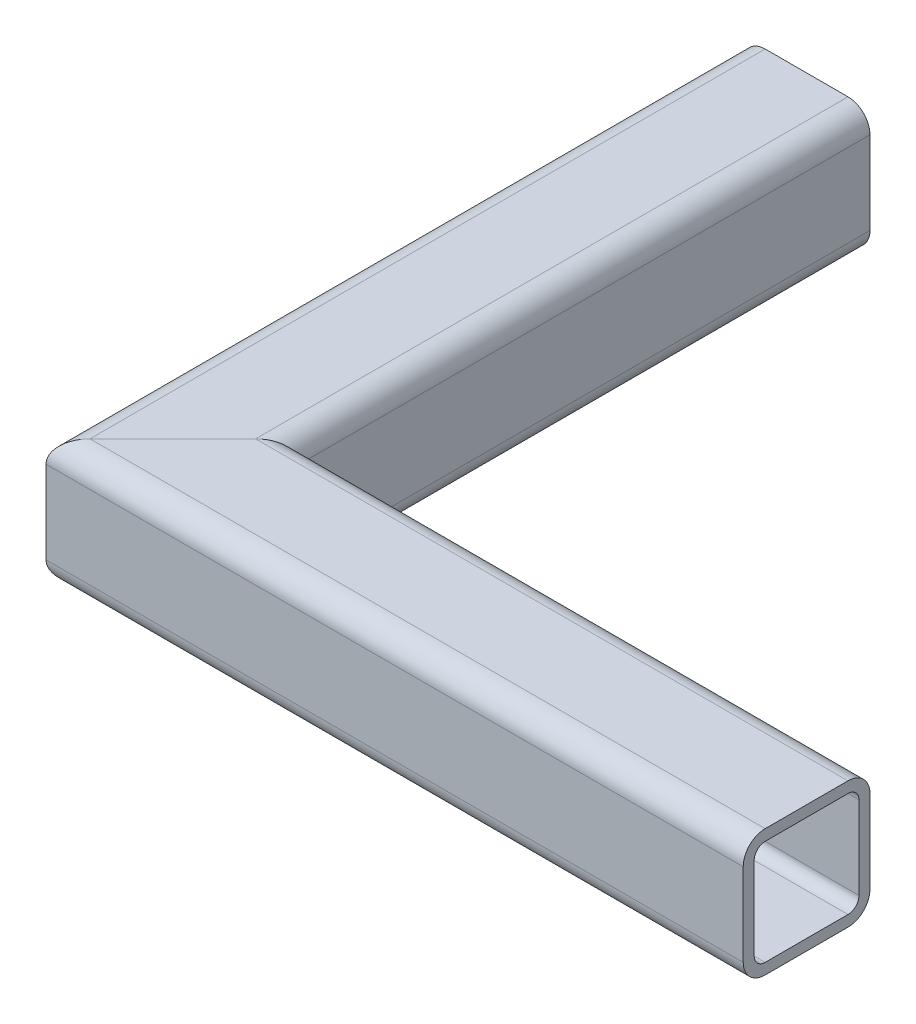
ISO-10303-21;
HEADER;
FILE_DESCRIPTION(('STEP AP214'),'2;1');
FILE_NAME('part.step','',(''),(''),'','','');
FILE_SCHEMA(('AUTOMOTIVE_DESIGN { 1 0 10303 214 1 1 1 1 }'));
ENDSEC;
DATA;
#1=APPLICATION_CONTEXT('core data for automotive mechanical design processes');
#2=APPLICATION_PROTOCOL_DEFINITION('international standard','automotive_design',2000,#1);
#3=PRODUCT_CONTEXT('',#1,'mechanical');
#4=PRODUCT('Part','Part','',(#3));
#5=PRODUCT_RELATED_PRODUCT_CATEGORY('part','',(#4));
#6=PRODUCT_DEFINITION_FORMATION('','',#4);
#7=PRODUCT_DEFINITION_CONTEXT('part definition',#1,'design');
#8=PRODUCT_DEFINITION('design','',#6,#7);
#9=PRODUCT_DEFINITION_SHAPE('','',#8);
#10=(LENGTH_UNIT() NAMED_UNIT(*) SI_UNIT(.MILLI.,.METRE.));
#11=(NAMED_UNIT(*) PLANE_ANGLE_UNIT() SI_UNIT($,.RADIAN.));
#12=(NAMED_UNIT(*) SI_UNIT($,.STERADIAN.) SOLID_ANGLE_UNIT());
#13=UNCERTAINTY_MEASURE_WITH_UNIT(LENGTH_MEASURE(1.E-05),#10,'distance_accuracy_value','');
#14=(GEOMETRIC_REPRESENTATION_CONTEXT(3) GLOBAL_UNCERTAINTY_ASSIGNED_CONTEXT((#13)) GLOBAL_UNIT_ASSIGNED_CONTEXT((#10,
#11,#12)) REPRESENTATION_CONTEXT('',''));
#15=CARTESIAN_POINT('',(0.,0.,0.));
#16=DIRECTION('',(0.,0.,1.));
#17=DIRECTION('',(1.,0.,0.));
#18=AXIS2_PLACEMENT_3D('',#15,#16,#17);
#19=CARTESIAN_POINT('',(-12.4,-9.8,0.));
#20=DIRECTION('',(1.,0.,0.));
#21=DIRECTION('',(0.,0.,-1.));
#22=AXIS2_PLACEMENT_3D('',#19,#20,#21);
#23=PLANE('',#22);
#24=DIRECTION('',(0.,1.,0.));
#25=VECTOR('',#24,1.);
#26=CARTESIAN_POINT('',(-12.4,-9.8,12.4));
#27=LINE('',#26,#25);
#28=CARTESIAN_POINT('',(-12.4,-9.8,12.4));
#29=VERTEX_POINT('',#28);
#30=CARTESIAN_POINT('',(-12.4,9.8,12.4));
#31=VERTEX_POINT('',#30);
#32=EDGE_CURVE('E13',#29,#31,#27,.T.);
#33=ORIENTED_EDGE('',*,*,#32,.F.);
#34=DIRECTION('',(0.,0.,-1.));
#35=VECTOR('',#34,1.);
#36=CARTESIAN_POINT('',(-12.4,-9.8,0.));
#37=LINE('',#36,#35);
#38=CARTESIAN_POINT('',(-12.4,-9.8,-150.));
#39=VERTEX_POINT('',#38);
#40=EDGE_CURVE('E354',#29,#39,#37,.T.);
#41=ORIENTED_EDGE('',*,*,#40,.T.);
#42=DIRECTION('',(0.,-1.,0.));
#43=VECTOR('',#42,1.);
#44=CARTESIAN_POINT('',(-12.4,-9.8,-150.));
#45=LINE('',#44,#43);
#46=CARTESIAN_POINT('',(-12.4,9.80000000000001,-150.));
#47=VERTEX_POINT('',#46);
#48=EDGE_CURVE('E312',#47,#39,#45,.T.);
#49=ORIENTED_EDGE('',*,*,#48,.F.);
#50=DIRECTION('',(0.,0.,-1.));
#51=VECTOR('',#50,1.);
#52=CARTESIAN_POINT('',(-12.4,9.80000000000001,0.));
#53=LINE('',#52,#51);
#54=EDGE_CURVE('E287',#31,#47,#53,.T.);
#55=ORIENTED_EDGE('',*,*,#54,.F.);
#56=EDGE_LOOP('',(#33,#41,#49,#55));
#57=FACE_BOUND('',#56,.T.);
#58=ADVANCED_FACE('F151',(#57),#23,.T.);
#59=CARTESIAN_POINT('',(-9.8,-9.8,0.));
#60=DIRECTION('',(0.,0.,-1.));
#61=DIRECTION('',(-1.,0.,0.));
#62=AXIS2_PLACEMENT_3D('',#59,#60,#61);
#63=CYLINDRICAL_SURFACE('',#62,2.6);
#64=CARTESIAN_POINT('',(-9.8,-9.80000000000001,9.8));
#65=DIRECTION('',(-0.707106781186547,0.,-0.707106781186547));
#66=DIRECTION('',(0.707106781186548,0.,-0.707106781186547));
#67=AXIS2_PLACEMENT_3D('',#64,#65,#66);
#68=ELLIPSE('',#67,3.67695526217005,2.6);
#69=CARTESIAN_POINT('',(-9.8,-12.4,9.79999999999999));
#70=VERTEX_POINT('',#69);
#71=EDGE_CURVE('E395',#70,#29,#68,.T.);
#72=ORIENTED_EDGE('',*,*,#71,.F.);
#73=DIRECTION('',(0.,0.,-1.));
#74=VECTOR('',#73,1.);
#75=CARTESIAN_POINT('',(-9.8,-12.4,0.));
#76=LINE('',#75,#74);
#77=CARTESIAN_POINT('',(-9.8,-12.4,-150.));
#78=VERTEX_POINT('',#77);
#79=EDGE_CURVE('E356',#70,#78,#76,.T.);
#80=ORIENTED_EDGE('',*,*,#79,.T.);
#81=CARTESIAN_POINT('',(-9.8,-9.8,-150.));
#82=DIRECTION('',(0.,0.,1.));
#83=DIRECTION('',(1.,0.,0.));
#84=AXIS2_PLACEMENT_3D('',#81,#82,#83);
#85=CIRCLE('',#84,2.6);
#86=EDGE_CURVE('E309',#39,#78,#85,.T.);
#87=ORIENTED_EDGE('',*,*,#86,.F.);
#88=ORIENTED_EDGE('',*,*,#40,.F.);
#89=EDGE_LOOP('',(#72,#80,#87,#88));
#90=FACE_BOUND('',#89,.T.);
#91=ADVANCED_FACE('F412',(#90),#63,.F.);
#92=CARTESIAN_POINT('',(-9.8,-12.4,0.));
#93=DIRECTION('',(0.,1.,0.));
#94=DIRECTION('',(0.,0.,1.));
#95=AXIS2_PLACEMENT_3D('',#92,#93,#94);
#96=PLANE('',#95);
#97=DIRECTION('',(-0.707106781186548,0.,0.707106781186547));
#98=VECTOR('',#97,1.);
#99=CARTESIAN_POINT('',(-4.9,-12.4,4.89999999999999));
#100=LINE('',#99,#98);
#101=CARTESIAN_POINT('',(9.8,-12.4,-9.80000000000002));
#102=VERTEX_POINT('',#101);
#103=EDGE_CURVE('E199',#102,#70,#100,.T.);
#104=ORIENTED_EDGE('',*,*,#103,.F.);
#105=DIRECTION('',(0.,0.,-1.));
#106=VECTOR('',#105,1.);
#107=CARTESIAN_POINT('',(9.8,-12.4,0.));
#108=LINE('',#107,#106);
#109=CARTESIAN_POINT('',(9.80000000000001,-12.4,-150.));
#110=VERTEX_POINT('',#109);
#111=EDGE_CURVE('E358',#102,#110,#108,.T.);
#112=ORIENTED_EDGE('',*,*,#111,.T.);
#113=DIRECTION('',(1.,0.,0.));
#114=VECTOR('',#113,1.);
#115=CARTESIAN_POINT('',(-9.8,-12.4,-150.));
#116=LINE('',#115,#114);
#117=EDGE_CURVE('E306',#78,#110,#116,.T.);
#118=ORIENTED_EDGE('',*,*,#117,.F.);
#119=ORIENTED_EDGE('',*,*,#79,.F.);
#120=EDGE_LOOP('',(#104,#112,#118,#119));
#121=FACE_BOUND('',#120,.T.);
#122=ADVANCED_FACE('F404',(#121),#96,.T.);
#123=CARTESIAN_POINT('',(9.8,-9.8,0.));
#124=DIRECTION('',(0.,0.,-1.));
#125=DIRECTION('',(-1.,0.,0.));
#126=AXIS2_PLACEMENT_3D('',#123,#124,#125);
#127=CYLINDRICAL_SURFACE('',#126,2.6);
#128=CARTESIAN_POINT('',(9.8,-9.8,-9.8));
#129=DIRECTION('',(-0.707106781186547,0.,-0.707106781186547));
#130=DIRECTION('',(0.707106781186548,0.,-0.707106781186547));
#131=AXIS2_PLACEMENT_3D('',#128,#129,#130);
#132=ELLIPSE('',#131,3.67695526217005,2.6);
#133=CARTESIAN_POINT('',(12.4,-9.8,-12.4));
#134=VERTEX_POINT('',#133);
#135=EDGE_CURVE('E374',#134,#102,#132,.T.);
#136=ORIENTED_EDGE('',*,*,#135,.F.);
#137=DIRECTION('',(0.,0.,-1.));
#138=VECTOR('',#137,1.);
#139=CARTESIAN_POINT('',(12.4,-9.8,0.));
#140=LINE('',#139,#138);
#141=CARTESIAN_POINT('',(12.4,-9.8,-150.));
#142=VERTEX_POINT('',#141);
#143=EDGE_CURVE('E360',#134,#142,#140,.T.);
#144=ORIENTED_EDGE('',*,*,#143,.T.);
#145=CARTESIAN_POINT('',(9.80000000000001,-9.8,-150.));
#146=DIRECTION('',(0.,0.,1.));
#147=DIRECTION('',(1.,0.,0.));
#148=AXIS2_PLACEMENT_3D('',#145,#146,#147);
#149=CIRCLE('',#148,2.6);
#150=EDGE_CURVE('E303',#110,#142,#149,.T.);
#151=ORIENTED_EDGE('',*,*,#150,.F.);
#152=ORIENTED_EDGE('',*,*,#111,.F.);
#153=EDGE_LOOP('',(#136,#144,#151,#152));
#154=FACE_BOUND('',#153,.T.);
#155=ADVANCED_FACE('F407',(#154),#127,.F.);
#156=CARTESIAN_POINT('',(12.4,9.80000000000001,0.));
#157=DIRECTION('',(-1.,0.,0.));
#158=DIRECTION('',(0.,0.,1.));
#159=AXIS2_PLACEMENT_3D('',#156,#157,#158);
#160=PLANE('',#159);
#161=DIRECTION('',(0.,-1.,0.));
#162=VECTOR('',#161,1.);
#163=CARTESIAN_POINT('',(12.4,9.80000000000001,-12.4));
#164=LINE('',#163,#162);
#165=CARTESIAN_POINT('',(12.4,9.80000000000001,-12.4));
#166=VERTEX_POINT('',#165);
#167=EDGE_CURVE('E370',#166,#134,#164,.T.);
#168=ORIENTED_EDGE('',*,*,#167,.F.);
#169=DIRECTION('',(0.,0.,-1.));
#170=VECTOR('',#169,1.);
#171=CARTESIAN_POINT('',(12.4,9.80000000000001,0.));
#172=LINE('',#171,#170);
#173=CARTESIAN_POINT('',(12.4,9.8,-150.));
#174=VERTEX_POINT('',#173);
#175=EDGE_CURVE('E362',#166,#174,#172,.T.);
#176=ORIENTED_EDGE('',*,*,#175,.T.);
#177=DIRECTION('',(0.,1.,0.));
#178=VECTOR('',#177,1.);
#179=CARTESIAN_POINT('',(12.4,9.8,-150.));
#180=LINE('',#179,#178);
#181=EDGE_CURVE('E298',#142,#174,#180,.T.);
#182=ORIENTED_EDGE('',*,*,#181,.F.);
#183=ORIENTED_EDGE('',*,*,#143,.F.);
#184=EDGE_LOOP('',(#168,#176,#182,#183));
#185=FACE_BOUND('',#184,.T.);
#186=ADVANCED_FACE('F429',(#185),#160,.T.);
#187=CARTESIAN_POINT('',(9.8,9.8,0.));
#188=DIRECTION('',(0.,0.,-1.));
#189=DIRECTION('',(-1.,0.,0.));
#190=AXIS2_PLACEMENT_3D('',#187,#188,#189);
#191=CYLINDRICAL_SURFACE('',#190,2.6);
#192=CARTESIAN_POINT('',(9.8,9.8,-9.80000000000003));
#193=DIRECTION('',(-0.707106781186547,0.,-0.707106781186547));
#194=DIRECTION('',(0.707106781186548,0.,-0.707106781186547));
#195=AXIS2_PLACEMENT_3D('',#192,#193,#194);
#196=ELLIPSE('',#195,3.67695526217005,2.6);
#197=CARTESIAN_POINT('',(9.8,12.4,-9.80000000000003));
#198=VERTEX_POINT('',#197);
#199=EDGE_CURVE('E368',#198,#166,#196,.T.);
#200=ORIENTED_EDGE('',*,*,#199,.F.);
#201=DIRECTION('',(0.,0.,-1.));
#202=VECTOR('',#201,1.);
#203=CARTESIAN_POINT('',(9.8,12.4,0.));
#204=LINE('',#203,#202);
#205=CARTESIAN_POINT('',(9.80000000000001,12.4,-150.));
#206=VERTEX_POINT('',#205);
#207=EDGE_CURVE('E283',#198,#206,#204,.T.);
#208=ORIENTED_EDGE('',*,*,#207,.T.);
#209=CARTESIAN_POINT('',(9.80000000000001,9.80000000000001,-150.));
#210=DIRECTION('',(0.,0.,1.));
#211=DIRECTION('',(1.,0.,0.));
#212=AXIS2_PLACEMENT_3D('',#209,#210,#211);
#213=CIRCLE('',#212,2.6);
#214=EDGE_CURVE('E296',#174,#206,#213,.T.);
#215=ORIENTED_EDGE('',*,*,#214,.F.);
#216=ORIENTED_EDGE('',*,*,#175,.F.);
#217=EDGE_LOOP('',(#200,#208,#215,#216));
#218=FACE_BOUND('',#217,.T.);
#219=ADVANCED_FACE('F366',(#218),#191,.F.);
#220=CARTESIAN_POINT('',(9.8,12.4,0.));
#221=DIRECTION('',(0.,-1.,0.));
#222=DIRECTION('',(0.,0.,-1.));
#223=AXIS2_PLACEMENT_3D('',#220,#221,#222);
#224=PLANE('',#223);
#225=DIRECTION('',(0.707106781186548,0.,-0.707106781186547));
#226=VECTOR('',#225,1.);
#227=CARTESIAN_POINT('',(4.9,12.4,-4.90000000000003));
#228=LINE('',#227,#226);
#229=CARTESIAN_POINT('',(-9.80000000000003,12.4,9.80000000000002));
#230=VERTEX_POINT('',#229);
#231=EDGE_CURVE('E279',#230,#198,#228,.T.);
#232=ORIENTED_EDGE('',*,*,#231,.F.);
#233=DIRECTION('',(0.,0.,-1.));
#234=VECTOR('',#233,1.);
#235=CARTESIAN_POINT('',(-9.8,12.4,0.));
#236=LINE('',#235,#234);
#237=CARTESIAN_POINT('',(-9.8,12.4,-150.));
#238=VERTEX_POINT('',#237);
#239=EDGE_CURVE('E272',#230,#238,#236,.T.);
#240=ORIENTED_EDGE('',*,*,#239,.T.);
#241=DIRECTION('',(-1.,0.,0.));
#242=VECTOR('',#241,1.);
#243=CARTESIAN_POINT('',(9.80000000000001,12.4,-150.));
#244=LINE('',#243,#242);
#245=EDGE_CURVE('E277',#206,#238,#244,.T.);
#246=ORIENTED_EDGE('',*,*,#245,.F.);
#247=ORIENTED_EDGE('',*,*,#207,.F.);
#248=EDGE_LOOP('',(#232,#240,#246,#247));
#249=FACE_BOUND('',#248,.T.);
#250=ADVANCED_FACE('F274',(#249),#224,.T.);
#251=CARTESIAN_POINT('',(-9.8,9.8,0.));
#252=DIRECTION('',(0.,0.,-1.));
#253=DIRECTION('',(-1.,0.,0.));
#254=AXIS2_PLACEMENT_3D('',#251,#252,#253);
#255=CYLINDRICAL_SURFACE('',#254,2.6);
#256=CARTESIAN_POINT('',(-9.8,9.8,9.8));
#257=DIRECTION('',(-0.707106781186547,0.,-0.707106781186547));
#258=DIRECTION('',(0.707106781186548,0.,-0.707106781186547));
#259=AXIS2_PLACEMENT_3D('',#256,#257,#258);
#260=ELLIPSE('',#259,3.67695526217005,2.6);
#261=EDGE_CURVE('E372',#31,#230,#260,.T.);
#262=ORIENTED_EDGE('',*,*,#261,.F.);
#263=ORIENTED_EDGE('',*,*,#54,.T.);
#264=CARTESIAN_POINT('',(-9.79999999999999,9.8,-150.));
#265=DIRECTION('',(0.,0.,1.));
#266=DIRECTION('',(1.,0.,0.));
#267=AXIS2_PLACEMENT_3D('',#264,#265,#266);
#268=CIRCLE('',#267,2.6);
#269=EDGE_CURVE('E285',#238,#47,#268,.T.);
#270=ORIENTED_EDGE('',*,*,#269,.F.);
#271=ORIENTED_EDGE('',*,*,#239,.F.);
#272=EDGE_LOOP('',(#262,#263,#270,#271));
#273=FACE_BOUND('',#272,.T.);
#274=ADVANCED_FACE('F153',(#273),#255,.F.);
#275=CARTESIAN_POINT('',(9.80000000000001,9.80000000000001,-150.));
#276=DIRECTION('',(0.,0.,1.));
#277=DIRECTION('',(1.,0.,0.));
#278=AXIS2_PLACEMENT_3D('',#275,#276,#277);
#279=PLANE('',#278);
#280=ORIENTED_EDGE('',*,*,#269,.T.);
#281=ORIENTED_EDGE('',*,*,#48,.T.);
#282=ORIENTED_EDGE('',*,*,#86,.T.);
#283=ORIENTED_EDGE('',*,*,#117,.T.);
#284=ORIENTED_EDGE('',*,*,#150,.T.);
#285=ORIENTED_EDGE('',*,*,#181,.T.);
#286=ORIENTED_EDGE('',*,*,#214,.T.);
#287=ORIENTED_EDGE('',*,*,#245,.T.);
#288=EDGE_LOOP('',(#280,#281,#282,#283,#284,#285,#286,#287));
#289=FACE_BOUND('',#288,.T.);
#290=CARTESIAN_POINT('',(9.80000000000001,9.80000000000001,-150.));
#291=DIRECTION('',(0.,0.,1.));
#292=DIRECTION('',(1.,0.,0.));
#293=AXIS2_PLACEMENT_3D('',#290,#291,#292);
#294=CIRCLE('',#293,5.2);
#295=CARTESIAN_POINT('',(15.,9.8,-150.));
#296=VERTEX_POINT('',#295);
#297=CARTESIAN_POINT('',(9.80000000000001,15.,-150.));
#298=VERTEX_POINT('',#297);
#299=EDGE_CURVE('E314',#296,#298,#294,.T.);
#300=ORIENTED_EDGE('',*,*,#299,.F.);
#301=DIRECTION('',(0.,1.,0.));
#302=VECTOR('',#301,1.);
#303=CARTESIAN_POINT('',(15.,9.8,-150.));
#304=LINE('',#303,#302);
#305=CARTESIAN_POINT('',(15.,-9.8,-150.));
#306=VERTEX_POINT('',#305);
#307=EDGE_CURVE('E335',#306,#296,#304,.T.);
#308=ORIENTED_EDGE('',*,*,#307,.F.);
#309=CARTESIAN_POINT('',(9.80000000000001,-9.8,-150.));
#310=DIRECTION('',(0.,0.,1.));
#311=DIRECTION('',(1.,0.,0.));
#312=AXIS2_PLACEMENT_3D('',#309,#310,#311);
#313=CIRCLE('',#312,5.2);
#314=CARTESIAN_POINT('',(9.80000000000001,-15.,-150.));
#315=VERTEX_POINT('',#314);
#316=EDGE_CURVE('E332',#315,#306,#313,.T.);
#317=ORIENTED_EDGE('',*,*,#316,.F.);
#318=DIRECTION('',(1.,0.,0.));
#319=VECTOR('',#318,1.);
#320=CARTESIAN_POINT('',(-9.8,-15.,-150.));
#321=LINE('',#320,#319);
#322=CARTESIAN_POINT('',(-9.8,-15.,-150.));
#323=VERTEX_POINT('',#322);
#324=EDGE_CURVE('E329',#323,#315,#321,.T.);
#325=ORIENTED_EDGE('',*,*,#324,.F.);
#326=CARTESIAN_POINT('',(-9.8,-9.8,-150.));
#327=DIRECTION('',(0.,0.,1.));
#328=DIRECTION('',(1.,0.,0.));
#329=AXIS2_PLACEMENT_3D('',#326,#327,#328);
#330=CIRCLE('',#329,5.2);
#331=CARTESIAN_POINT('',(-15.,-9.8,-150.));
#332=VERTEX_POINT('',#331);
#333=EDGE_CURVE('E326',#332,#323,#330,.T.);
#334=ORIENTED_EDGE('',*,*,#333,.F.);
#335=DIRECTION('',(0.,-1.,0.));
#336=VECTOR('',#335,1.);
#337=CARTESIAN_POINT('',(-15.,-9.8,-150.));
#338=LINE('',#337,#336);
#339=CARTESIAN_POINT('',(-15.,9.8,-150.));
#340=VERTEX_POINT('',#339);
#341=EDGE_CURVE('E323',#340,#332,#338,.T.);
#342=ORIENTED_EDGE('',*,*,#341,.F.);
#343=CARTESIAN_POINT('',(-9.79999999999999,9.8,-150.));
#344=DIRECTION('',(0.,0.,1.));
#345=DIRECTION('',(1.,0.,0.));
#346=AXIS2_PLACEMENT_3D('',#343,#344,#345);
#347=CIRCLE('',#346,5.2);
#348=CARTESIAN_POINT('',(-9.8,15.,-150.));
#349=VERTEX_POINT('',#348);
#350=EDGE_CURVE('E320',#349,#340,#347,.T.);
#351=ORIENTED_EDGE('',*,*,#350,.F.);
#352=DIRECTION('',(-1.,0.,0.));
#353=VECTOR('',#352,1.);
#354=CARTESIAN_POINT('',(9.80000000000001,15.,-150.));
#355=LINE('',#354,#353);
#356=EDGE_CURVE('E317',#298,#349,#355,.T.);
#357=ORIENTED_EDGE('',*,*,#356,.F.);
#358=EDGE_LOOP('',(#300,#308,#317,#325,#334,#342,#351,#357));
#359=FACE_BOUND('',#358,.T.);
#360=ADVANCED_FACE('F292',(#289,#359),#279,.F.);
#361=CARTESIAN_POINT('',(15.,9.8,0.));
#362=DIRECTION('',(-1.,0.,0.));
#363=DIRECTION('',(0.,0.,1.));
#364=AXIS2_PLACEMENT_3D('',#361,#362,#363);
#365=PLANE('',#364);
#366=DIRECTION('',(0.,0.,-1.));
#367=VECTOR('',#366,1.);
#368=CARTESIAN_POINT('',(15.,9.8,0.));
#369=LINE('',#368,#367);
#370=CARTESIAN_POINT('',(15.,9.8,-15.));
#371=VERTEX_POINT('',#370);
#372=EDGE_CURVE('E282',#371,#296,#369,.T.);
#373=ORIENTED_EDGE('',*,*,#372,.F.);
#374=DIRECTION('',(0.,-1.,0.));
#375=VECTOR('',#374,1.);
#376=CARTESIAN_POINT('',(15.,9.8,-15.));
#377=LINE('',#376,#375);
#378=CARTESIAN_POINT('',(15.,-9.8,-15.));
#379=VERTEX_POINT('',#378);
#380=EDGE_CURVE('E155',#371,#379,#377,.T.);
#381=ORIENTED_EDGE('',*,*,#380,.T.);
#382=DIRECTION('',(0.,0.,-1.));
#383=VECTOR('',#382,1.);
#384=CARTESIAN_POINT('',(15.,-9.8,0.));
#385=LINE('',#384,#383);
#386=EDGE_CURVE('E339',#379,#306,#385,.T.);
#387=ORIENTED_EDGE('',*,*,#386,.T.);
#388=ORIENTED_EDGE('',*,*,#307,.T.);
#389=EDGE_LOOP('',(#373,#381,#387,#388));
#390=FACE_BOUND('',#389,.T.);
#391=ADVANCED_FACE('F441',(#390),#365,.F.);
#392=CARTESIAN_POINT('',(9.8,-9.8,0.));
#393=DIRECTION('',(0.,0.,-1.));
#394=DIRECTION('',(-1.,0.,0.));
#395=AXIS2_PLACEMENT_3D('',#392,#393,#394);
#396=CYLINDRICAL_SURFACE('',#395,5.2);
#397=ORIENTED_EDGE('',*,*,#386,.F.);
#398=CARTESIAN_POINT('',(9.8,-9.8,-9.8));
#399=DIRECTION('',(-0.707106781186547,0.,-0.707106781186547));
#400=DIRECTION('',(0.707106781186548,0.,-0.707106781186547));
#401=AXIS2_PLACEMENT_3D('',#398,#399,#400);
#402=ELLIPSE('',#401,7.35391052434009,5.2);
#403=CARTESIAN_POINT('',(9.8,-15.,-9.8));
#404=VERTEX_POINT('',#403);
#405=EDGE_CURVE('E377',#379,#404,#402,.T.);
#406=ORIENTED_EDGE('',*,*,#405,.T.);
#407=DIRECTION('',(0.,0.,-1.));
#408=VECTOR('',#407,1.);
#409=CARTESIAN_POINT('',(9.8,-15.,0.));
#410=LINE('',#409,#408);
#411=EDGE_CURVE('E341',#404,#315,#410,.T.);
#412=ORIENTED_EDGE('',*,*,#411,.T.);
#413=ORIENTED_EDGE('',*,*,#316,.T.);
#414=EDGE_LOOP('',(#397,#406,#412,#413));
#415=FACE_BOUND('',#414,.T.);
#416=ADVANCED_FACE('F446',(#415),#396,.T.);
#417=CARTESIAN_POINT('',(-9.8,-15.,0.));
#418=DIRECTION('',(0.,1.,0.));
#419=DIRECTION('',(0.,0.,1.));
#420=AXIS2_PLACEMENT_3D('',#417,#418,#419);
#421=PLANE('',#420);
#422=ORIENTED_EDGE('',*,*,#411,.F.);
#423=DIRECTION('',(-0.707106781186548,0.,0.707106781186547));
#424=VECTOR('',#423,1.);
#425=CARTESIAN_POINT('',(-4.9,-15.,4.9));
#426=LINE('',#425,#424);
#427=CARTESIAN_POINT('',(-9.80000000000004,-15.,9.80000000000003));
#428=VERTEX_POINT('',#427);
#429=EDGE_CURVE('E186',#404,#428,#426,.T.);
#430=ORIENTED_EDGE('',*,*,#429,.T.);
#431=DIRECTION('',(0.,0.,-1.));
#432=VECTOR('',#431,1.);
#433=CARTESIAN_POINT('',(-9.8,-15.,0.));
#434=LINE('',#433,#432);
#435=EDGE_CURVE('E343',#428,#323,#434,.T.);
#436=ORIENTED_EDGE('',*,*,#435,.T.);
#437=ORIENTED_EDGE('',*,*,#324,.T.);
#438=EDGE_LOOP('',(#422,#430,#436,#437));
#439=FACE_BOUND('',#438,.T.);
#440=ADVANCED_FACE('F453',(#439),#421,.F.);
#441=CARTESIAN_POINT('',(-9.8,-9.8,0.));
#442=DIRECTION('',(0.,0.,-1.));
#443=DIRECTION('',(-1.,0.,0.));
#444=AXIS2_PLACEMENT_3D('',#441,#442,#443);
#445=CYLINDRICAL_SURFACE('',#444,5.2);
#446=ORIENTED_EDGE('',*,*,#435,.F.);
#447=CARTESIAN_POINT('',(-9.8,-9.80000000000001,9.8));
#448=DIRECTION('',(-0.707106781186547,0.,-0.707106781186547));
#449=DIRECTION('',(0.707106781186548,0.,-0.707106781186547));
#450=AXIS2_PLACEMENT_3D('',#447,#448,#449);
#451=ELLIPSE('',#450,7.35391052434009,5.2);
#452=CARTESIAN_POINT('',(-15.,-9.8,15.));
#453=VERTEX_POINT('',#452);
#454=EDGE_CURVE('E382',#428,#453,#451,.T.);
#455=ORIENTED_EDGE('',*,*,#454,.T.);
#456=DIRECTION('',(0.,0.,-1.));
#457=VECTOR('',#456,1.);
#458=CARTESIAN_POINT('',(-15.,-9.8,0.));
#459=LINE('',#458,#457);
#460=EDGE_CURVE('E345',#453,#332,#459,.T.);
#461=ORIENTED_EDGE('',*,*,#460,.T.);
#462=ORIENTED_EDGE('',*,*,#333,.T.);
#463=EDGE_LOOP('',(#446,#455,#461,#462));
#464=FACE_BOUND('',#463,.T.);
#465=ADVANCED_FACE('F456',(#464),#445,.T.);
#466=CARTESIAN_POINT('',(-15.,-9.8,0.));
#467=DIRECTION('',(1.,0.,0.));
#468=DIRECTION('',(0.,0.,-1.));
#469=AXIS2_PLACEMENT_3D('',#466,#467,#468);
#470=PLANE('',#469);
#471=ORIENTED_EDGE('',*,*,#460,.F.);
#472=DIRECTION('',(0.,1.,0.));
#473=VECTOR('',#472,1.);
#474=CARTESIAN_POINT('',(-15.,-9.8,15.));
#475=LINE('',#474,#473);
#476=CARTESIAN_POINT('',(-15.,9.8,15.));
#477=VERTEX_POINT('',#476);
#478=EDGE_CURVE('E387',#453,#477,#475,.T.);
#479=ORIENTED_EDGE('',*,*,#478,.T.);
#480=DIRECTION('',(0.,0.,-1.));
#481=VECTOR('',#480,1.);
#482=CARTESIAN_POINT('',(-15.,9.8,0.));
#483=LINE('',#482,#481);
#484=EDGE_CURVE('E347',#477,#340,#483,.T.);
#485=ORIENTED_EDGE('',*,*,#484,.T.);
#486=ORIENTED_EDGE('',*,*,#341,.T.);
#487=EDGE_LOOP('',(#471,#479,#485,#486));
#488=FACE_BOUND('',#487,.T.);
#489=ADVANCED_FACE('F460',(#488),#470,.F.);
#490=CARTESIAN_POINT('',(-9.8,9.8,0.));
#491=DIRECTION('',(0.,0.,-1.));
#492=DIRECTION('',(-1.,0.,0.));
#493=AXIS2_PLACEMENT_3D('',#490,#491,#492);
#494=CYLINDRICAL_SURFACE('',#493,5.2);
#495=ORIENTED_EDGE('',*,*,#484,.F.);
#496=CARTESIAN_POINT('',(-9.8,9.8,9.8));
#497=DIRECTION('',(-0.707106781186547,0.,-0.707106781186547));
#498=DIRECTION('',(0.707106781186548,0.,-0.707106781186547));
#499=AXIS2_PLACEMENT_3D('',#496,#497,#498);
#500=ELLIPSE('',#499,7.35391052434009,5.2);
#501=CARTESIAN_POINT('',(-9.8,15.,9.79999999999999));
#502=VERTEX_POINT('',#501);
#503=EDGE_CURVE('E390',#477,#502,#500,.T.);
#504=ORIENTED_EDGE('',*,*,#503,.T.);
#505=DIRECTION('',(0.,0.,-1.));
#506=VECTOR('',#505,1.);
#507=CARTESIAN_POINT('',(-9.8,15.,0.));
#508=LINE('',#507,#506);
#509=EDGE_CURVE('E349',#502,#349,#508,.T.);
#510=ORIENTED_EDGE('',*,*,#509,.T.);
#511=ORIENTED_EDGE('',*,*,#350,.T.);
#512=EDGE_LOOP('',(#495,#504,#510,#511));
#513=FACE_BOUND('',#512,.T.);
#514=ADVANCED_FACE('F464',(#513),#494,.T.);
#515=CARTESIAN_POINT('',(9.8,15.,0.));
#516=DIRECTION('',(0.,-1.,0.));
#517=DIRECTION('',(0.,0.,-1.));
#518=AXIS2_PLACEMENT_3D('',#515,#516,#517);
#519=PLANE('',#518);
#520=ORIENTED_EDGE('',*,*,#509,.F.);
#521=DIRECTION('',(0.707106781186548,0.,-0.707106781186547));
#522=VECTOR('',#521,1.);
#523=CARTESIAN_POINT('',(4.9,15.,-4.90000000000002));
#524=LINE('',#523,#522);
#525=CARTESIAN_POINT('',(9.80000000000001,15.,-9.80000000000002));
#526=VERTEX_POINT('',#525);
#527=EDGE_CURVE('E170',#502,#526,#524,.T.);
#528=ORIENTED_EDGE('',*,*,#527,.T.);
#529=DIRECTION('',(0.,0.,-1.));
#530=VECTOR('',#529,1.);
#531=CARTESIAN_POINT('',(9.8,15.,0.));
#532=LINE('',#531,#530);
#533=EDGE_CURVE('E351',#526,#298,#532,.T.);
#534=ORIENTED_EDGE('',*,*,#533,.T.);
#535=ORIENTED_EDGE('',*,*,#356,.T.);
#536=EDGE_LOOP('',(#520,#528,#534,#535));
#537=FACE_BOUND('',#536,.T.);
#538=ADVANCED_FACE('F467',(#537),#519,.F.);
#539=CARTESIAN_POINT('',(9.8,9.8,0.));
#540=DIRECTION('',(0.,0.,-1.));
#541=DIRECTION('',(-1.,0.,0.));
#542=AXIS2_PLACEMENT_3D('',#539,#540,#541);
#543=CYLINDRICAL_SURFACE('',#542,5.2);
#544=ORIENTED_EDGE('',*,*,#533,.F.);
#545=CARTESIAN_POINT('',(9.8,9.8,-9.80000000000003));
#546=DIRECTION('',(-0.707106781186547,0.,-0.707106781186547));
#547=DIRECTION('',(0.707106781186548,0.,-0.707106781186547));
#548=AXIS2_PLACEMENT_3D('',#545,#546,#547);
#549=ELLIPSE('',#548,7.35391052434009,5.2);
#550=EDGE_CURVE('E161',#526,#371,#549,.T.);
#551=ORIENTED_EDGE('',*,*,#550,.T.);
#552=ORIENTED_EDGE('',*,*,#372,.T.);
#553=ORIENTED_EDGE('',*,*,#299,.T.);
#554=EDGE_LOOP('',(#544,#551,#552,#553));
#555=FACE_BOUND('',#554,.T.);
#556=ADVANCED_FACE('F422',(#555),#543,.T.);
#557=CARTESIAN_POINT('',(0.,0.,0.));
#558=DIRECTION('',(-0.707106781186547,0.,-0.707106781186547));
#559=DIRECTION('',(-0.707106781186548,0.,0.707106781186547));
#560=AXIS2_PLACEMENT_3D('',#557,#558,#559);
#561=PLANE('',#560);
#562=ORIENTED_EDGE('',*,*,#261,.T.);
#563=ORIENTED_EDGE('',*,*,#231,.T.);
#564=ORIENTED_EDGE('',*,*,#199,.T.);
#565=ORIENTED_EDGE('',*,*,#167,.T.);
#566=ORIENTED_EDGE('',*,*,#135,.T.);
#567=ORIENTED_EDGE('',*,*,#103,.T.);
#568=ORIENTED_EDGE('',*,*,#71,.T.);
#569=ORIENTED_EDGE('',*,*,#32,.T.);
#570=EDGE_LOOP('',(#562,#563,#564,#565,#566,#567,#568,#569));
#571=FACE_BOUND('',#570,.T.);
#572=ORIENTED_EDGE('',*,*,#527,.F.);
#573=ORIENTED_EDGE('',*,*,#503,.F.);
#574=ORIENTED_EDGE('',*,*,#478,.F.);
#575=ORIENTED_EDGE('',*,*,#454,.F.);
#576=ORIENTED_EDGE('',*,*,#429,.F.);
#577=ORIENTED_EDGE('',*,*,#405,.F.);
#578=ORIENTED_EDGE('',*,*,#380,.F.);
#579=ORIENTED_EDGE('',*,*,#550,.F.);
#580=EDGE_LOOP('',(#572,#573,#574,#575,#576,#577,#578,#579));
#581=FACE_BOUND('',#580,.T.);
#582=ADVANCED_FACE('F398',(#571,#581),#561,.F.);
#583=CLOSED_SHELL('',(#58,#91,#122,#155,#186,#219,#250,#274,#360,#391,#416,#440,#465,#489,#514,
#538,#556,#582));
#584=MANIFOLD_SOLID_BREP('B2',#583);
#585=CARTESIAN_POINT('',(150.,9.8,-9.8));
#586=DIRECTION('',(-1.,0.,0.));
#587=DIRECTION('',(0.,0.,1.));
#588=AXIS2_PLACEMENT_3D('',#585,#586,#587);
#589=CYLINDRICAL_SURFACE('',#588,5.2);
#590=CARTESIAN_POINT('',(9.8,9.8,-9.80000000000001));
#591=DIRECTION('',(-0.707106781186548,0.,-0.707106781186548));
#592=DIRECTION('',(-0.707106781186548,0.,0.707106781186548));
#593=AXIS2_PLACEMENT_3D('',#590,#591,#592);
#594=ELLIPSE('',#593,7.35391052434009,5.2);
#595=CARTESIAN_POINT('',(9.80000000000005,15.,-9.80000000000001));
#596=VERTEX_POINT('',#595);
#597=CARTESIAN_POINT('',(15.,9.8,-15.));
#598=VERTEX_POINT('',#597);
#599=EDGE_CURVE('E825',#596,#598,#594,.T.);
#600=ORIENTED_EDGE('',*,*,#599,.F.);
#601=DIRECTION('',(-1.,0.,0.));
#602=VECTOR('',#601,1.);
#603=CARTESIAN_POINT('',(150.,15.,-9.80000000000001));
#604=LINE('',#603,#602);
#605=CARTESIAN_POINT('',(150.,15.,-9.80000000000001));
#606=VERTEX_POINT('',#605);
#607=EDGE_CURVE('E868',#606,#596,#604,.T.);
#608=ORIENTED_EDGE('',*,*,#607,.F.);
#609=CARTESIAN_POINT('',(150.,9.8,-9.8));
#610=DIRECTION('',(1.,0.,0.));
#611=DIRECTION('',(0.,0.,-1.));
#612=AXIS2_PLACEMENT_3D('',#609,#610,#611);
#613=CIRCLE('',#612,5.2);
#614=CARTESIAN_POINT('',(150.,9.8,-15.));
#615=VERTEX_POINT('',#614);
#616=EDGE_CURVE('E890',#615,#606,#613,.T.);
#617=ORIENTED_EDGE('',*,*,#616,.F.);
#618=DIRECTION('',(-1.,0.,0.));
#619=VECTOR('',#618,1.);
#620=CARTESIAN_POINT('',(150.,9.8,-15.));
#621=LINE('',#620,#619);
#622=EDGE_CURVE('E872',#615,#598,#621,.T.);
#623=ORIENTED_EDGE('',*,*,#622,.T.);
#624=EDGE_LOOP('',(#600,#608,#617,#623));
#625=FACE_BOUND('',#624,.T.);
#626=ADVANCED_FACE('F678',(#625),#589,.T.);
#627=CARTESIAN_POINT('',(150.,15.,-9.80000000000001));
#628=DIRECTION('',(0.,-1.,0.));
#629=DIRECTION('',(0.,0.,-1.));
#630=AXIS2_PLACEMENT_3D('',#627,#628,#629);
#631=PLANE('',#630);
#632=DIRECTION('',(0.707106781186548,0.,-0.707106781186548));
#633=VECTOR('',#632,1.);
#634=CARTESIAN_POINT('',(79.9,15.,-79.9));
#635=LINE('',#634,#633);
#636=CARTESIAN_POINT('',(-9.8,15.,9.80000000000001));
#637=VERTEX_POINT('',#636);
#638=EDGE_CURVE('E829',#637,#596,#635,.T.);
#639=ORIENTED_EDGE('',*,*,#638,.F.);
#640=DIRECTION('',(-1.,0.,0.));
#641=VECTOR('',#640,1.);
#642=CARTESIAN_POINT('',(150.,15.,9.80000000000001));
#643=LINE('',#642,#641);
#644=CARTESIAN_POINT('',(150.,15.,9.80000000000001));
#645=VERTEX_POINT('',#644);
#646=EDGE_CURVE('E871',#645,#637,#643,.T.);
#647=ORIENTED_EDGE('',*,*,#646,.F.);
#648=DIRECTION('',(0.,0.,1.));
#649=VECTOR('',#648,1.);
#650=CARTESIAN_POINT('',(150.,15.,-9.80000000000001));
#651=LINE('',#650,#649);
#652=EDGE_CURVE('E1178',#606,#645,#651,.T.);
#653=ORIENTED_EDGE('',*,*,#652,.F.);
#654=ORIENTED_EDGE('',*,*,#607,.T.);
#655=EDGE_LOOP('',(#639,#647,#653,#654));
#656=FACE_BOUND('',#655,.T.);
#657=ADVANCED_FACE('F934',(#656),#631,.F.);
#658=CARTESIAN_POINT('',(150.,9.8,9.80000000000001));
#659=DIRECTION('',(-1.,0.,0.));
#660=DIRECTION('',(0.,0.,1.));
#661=AXIS2_PLACEMENT_3D('',#658,#659,#660);
#662=CYLINDRICAL_SURFACE('',#661,5.2);
#663=CARTESIAN_POINT('',(-9.79999999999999,9.8,9.8));
#664=DIRECTION('',(-0.707106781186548,0.,-0.707106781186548));
#665=DIRECTION('',(-0.707106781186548,0.,0.707106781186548));
#666=AXIS2_PLACEMENT_3D('',#663,#664,#665);
#667=ELLIPSE('',#666,7.35391052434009,5.2);
#668=CARTESIAN_POINT('',(-15.,9.8,15.));
#669=VERTEX_POINT('',#668);
#670=EDGE_CURVE('E149',#669,#637,#667,.T.);
#671=ORIENTED_EDGE('',*,*,#670,.F.);
#672=DIRECTION('',(-1.,0.,0.));
#673=VECTOR('',#672,1.);
#674=CARTESIAN_POINT('',(150.,9.8,15.));
#675=LINE('',#674,#673);
#676=CARTESIAN_POINT('',(150.,9.8,15.));
#677=VERTEX_POINT('',#676);
#678=EDGE_CURVE('E875',#677,#669,#675,.T.);
#679=ORIENTED_EDGE('',*,*,#678,.F.);
#680=CARTESIAN_POINT('',(150.,9.8,9.80000000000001));
#681=DIRECTION('',(1.,0.,0.));
#682=DIRECTION('',(0.,0.,-1.));
#683=AXIS2_PLACEMENT_3D('',#680,#681,#682);
#684=CIRCLE('',#683,5.2);
#685=EDGE_CURVE('E1175',#645,#677,#684,.T.);
#686=ORIENTED_EDGE('',*,*,#685,.F.);
#687=ORIENTED_EDGE('',*,*,#646,.T.);
#688=EDGE_LOOP('',(#671,#679,#686,#687));
#689=FACE_BOUND('',#688,.T.);
#690=ADVANCED_FACE('F939',(#689),#662,.T.);
#691=CARTESIAN_POINT('',(150.,-9.8,15.));
#692=DIRECTION('',(0.,0.,-1.));
#693=DIRECTION('',(-1.,0.,0.));
#694=AXIS2_PLACEMENT_3D('',#691,#692,#693);
#695=PLANE('',#694);
#696=DIRECTION('',(0.,1.,0.));
#697=VECTOR('',#696,1.);
#698=CARTESIAN_POINT('',(-15.,-9.8,15.));
#699=LINE('',#698,#697);
#700=CARTESIAN_POINT('',(-15.,-9.8,15.));
#701=VERTEX_POINT('',#700);
#702=EDGE_CURVE('E688',#701,#669,#699,.T.);
#703=ORIENTED_EDGE('',*,*,#702,.F.);
#704=DIRECTION('',(-1.,0.,0.));
#705=VECTOR('',#704,1.);
#706=CARTESIAN_POINT('',(150.,-9.8,15.));
#707=LINE('',#706,#705);
#708=CARTESIAN_POINT('',(150.,-9.8,15.));
#709=VERTEX_POINT('',#708);
#710=EDGE_CURVE('E878',#709,#701,#707,.T.);
#711=ORIENTED_EDGE('',*,*,#710,.F.);
#712=DIRECTION('',(0.,-1.,0.));
#713=VECTOR('',#712,1.);
#714=CARTESIAN_POINT('',(150.,-9.8,15.));
#715=LINE('',#714,#713);
#716=EDGE_CURVE('E1177',#677,#709,#715,.T.);
#717=ORIENTED_EDGE('',*,*,#716,.F.);
#718=ORIENTED_EDGE('',*,*,#678,.T.);
#719=EDGE_LOOP('',(#703,#711,#717,#718));
#720=FACE_BOUND('',#719,.T.);
#721=ADVANCED_FACE('F945',(#720),#695,.F.);
#722=CARTESIAN_POINT('',(150.,-9.8,9.80000000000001));
#723=DIRECTION('',(-1.,0.,0.));
#724=DIRECTION('',(0.,0.,1.));
#725=AXIS2_PLACEMENT_3D('',#722,#723,#724);
#726=CYLINDRICAL_SURFACE('',#725,5.2);
#727=CARTESIAN_POINT('',(-9.80000000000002,-9.8,9.8));
#728=DIRECTION('',(-0.707106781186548,0.,-0.707106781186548));
#729=DIRECTION('',(-0.707106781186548,0.,0.707106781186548));
#730=AXIS2_PLACEMENT_3D('',#727,#728,#729);
#731=ELLIPSE('',#730,7.35391052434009,5.2);
#732=CARTESIAN_POINT('',(-9.79999999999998,-15.,9.8));
#733=VERTEX_POINT('',#732);
#734=EDGE_CURVE('E835',#733,#701,#731,.T.);
#735=ORIENTED_EDGE('',*,*,#734,.F.);
#736=DIRECTION('',(-1.,0.,0.));
#737=VECTOR('',#736,1.);
#738=CARTESIAN_POINT('',(150.,-15.,9.80000000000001));
#739=LINE('',#738,#737);
#740=CARTESIAN_POINT('',(150.,-15.,9.80000000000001));
#741=VERTEX_POINT('',#740);
#742=EDGE_CURVE('E881',#741,#733,#739,.T.);
#743=ORIENTED_EDGE('',*,*,#742,.F.);
#744=CARTESIAN_POINT('',(150.,-9.8,9.80000000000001));
#745=DIRECTION('',(1.,0.,0.));
#746=DIRECTION('',(0.,0.,-1.));
#747=AXIS2_PLACEMENT_3D('',#744,#745,#746);
#748=CIRCLE('',#747,5.2);
#749=EDGE_CURVE('E1180',#709,#741,#748,.T.);
#750=ORIENTED_EDGE('',*,*,#749,.F.);
#751=ORIENTED_EDGE('',*,*,#710,.T.);
#752=EDGE_LOOP('',(#735,#743,#750,#751));
#753=FACE_BOUND('',#752,.T.);
#754=ADVANCED_FACE('F949',(#753),#726,.T.);
#755=CARTESIAN_POINT('',(150.,-15.,9.80000000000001));
#756=DIRECTION('',(0.,1.,0.));
#757=DIRECTION('',(0.,0.,1.));
#758=AXIS2_PLACEMENT_3D('',#755,#756,#757);
#759=PLANE('',#758);
#760=DIRECTION('',(-0.707106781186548,0.,0.707106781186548));
#761=VECTOR('',#760,1.);
#762=CARTESIAN_POINT('',(70.1,-15.,-70.1));
#763=LINE('',#762,#761);
#764=CARTESIAN_POINT('',(9.79999999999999,-15.,-9.80000000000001));
#765=VERTEX_POINT('',#764);
#766=EDGE_CURVE('E838',#765,#733,#763,.T.);
#767=ORIENTED_EDGE('',*,*,#766,.F.);
#768=DIRECTION('',(-1.,0.,0.));
#769=VECTOR('',#768,1.);
#770=CARTESIAN_POINT('',(150.,-15.,-9.8));
#771=LINE('',#770,#769);
#772=CARTESIAN_POINT('',(150.,-15.,-9.8));
#773=VERTEX_POINT('',#772);
#774=EDGE_CURVE('E884',#773,#765,#771,.T.);
#775=ORIENTED_EDGE('',*,*,#774,.F.);
#776=DIRECTION('',(0.,0.,-1.));
#777=VECTOR('',#776,1.);
#778=CARTESIAN_POINT('',(150.,-15.,9.80000000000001));
#779=LINE('',#778,#777);
#780=EDGE_CURVE('E1195',#741,#773,#779,.T.);
#781=ORIENTED_EDGE('',*,*,#780,.F.);
#782=ORIENTED_EDGE('',*,*,#742,.T.);
#783=EDGE_LOOP('',(#767,#775,#781,#782));
#784=FACE_BOUND('',#783,.T.);
#785=ADVANCED_FACE('F953',(#784),#759,.F.);
#786=CARTESIAN_POINT('',(150.,-9.8,-9.8));
#787=DIRECTION('',(-1.,0.,0.));
#788=DIRECTION('',(0.,0.,1.));
#789=AXIS2_PLACEMENT_3D('',#786,#787,#788);
#790=CYLINDRICAL_SURFACE('',#789,5.2);
#791=CARTESIAN_POINT('',(9.79999999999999,-9.8,-9.8));
#792=DIRECTION('',(-0.707106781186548,0.,-0.707106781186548));
#793=DIRECTION('',(-0.707106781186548,0.,0.707106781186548));
#794=AXIS2_PLACEMENT_3D('',#791,#792,#793);
#795=ELLIPSE('',#794,7.35391052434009,5.2);
#796=CARTESIAN_POINT('',(15.,-9.8,-15.));
#797=VERTEX_POINT('',#796);
#798=EDGE_CURVE('E841',#797,#765,#795,.T.);
#799=ORIENTED_EDGE('',*,*,#798,.F.);
#800=DIRECTION('',(-1.,0.,0.));
#801=VECTOR('',#800,1.);
#802=CARTESIAN_POINT('',(150.,-9.8,-15.));
#803=LINE('',#802,#801);
#804=CARTESIAN_POINT('',(150.,-9.8,-15.));
#805=VERTEX_POINT('',#804);
#806=EDGE_CURVE('E887',#805,#797,#803,.T.);
#807=ORIENTED_EDGE('',*,*,#806,.F.);
#808=CARTESIAN_POINT('',(150.,-9.8,-9.8));
#809=DIRECTION('',(1.,0.,0.));
#810=DIRECTION('',(0.,0.,-1.));
#811=AXIS2_PLACEMENT_3D('',#808,#809,#810);
#812=CIRCLE('',#811,5.2);
#813=EDGE_CURVE('E1193',#773,#805,#812,.T.);
#814=ORIENTED_EDGE('',*,*,#813,.F.);
#815=ORIENTED_EDGE('',*,*,#774,.T.);
#816=EDGE_LOOP('',(#799,#807,#814,#815));
#817=FACE_BOUND('',#816,.T.);
#818=ADVANCED_FACE('F957',(#817),#790,.T.);
#819=CARTESIAN_POINT('',(150.,9.8,9.80000000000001));
#820=DIRECTION('',(-1.,0.,0.));
#821=DIRECTION('',(0.,0.,1.));
#822=AXIS2_PLACEMENT_3D('',#819,#820,#821);
#823=CYLINDRICAL_SURFACE('',#822,2.6);
#824=DIRECTION('',(-1.,0.,0.));
#825=VECTOR('',#824,1.);
#826=CARTESIAN_POINT('',(150.,9.8,12.4));
#827=LINE('',#826,#825);
#828=CARTESIAN_POINT('',(150.,9.8,12.4));
#829=VERTEX_POINT('',#828);
#830=CARTESIAN_POINT('',(-12.4,9.8,12.4));
#831=VERTEX_POINT('',#830);
#832=EDGE_CURVE('E682',#829,#831,#827,.T.);
#833=ORIENTED_EDGE('',*,*,#832,.T.);
#834=CARTESIAN_POINT('',(-9.79999999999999,9.8,9.8));
#835=DIRECTION('',(-0.707106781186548,0.,-0.707106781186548));
#836=DIRECTION('',(-0.707106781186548,0.,0.707106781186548));
#837=AXIS2_PLACEMENT_3D('',#834,#835,#836);
#838=ELLIPSE('',#837,3.67695526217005,2.6);
#839=CARTESIAN_POINT('',(-9.79999999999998,12.4,9.80000000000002));
#840=VERTEX_POINT('',#839);
#841=EDGE_CURVE('E724',#831,#840,#838,.T.);
#842=ORIENTED_EDGE('',*,*,#841,.T.);
#843=DIRECTION('',(-1.,0.,0.));
#844=VECTOR('',#843,1.);
#845=CARTESIAN_POINT('',(150.,12.4,9.80000000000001));
#846=LINE('',#845,#844);
#847=CARTESIAN_POINT('',(150.,12.4,9.80000000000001));
#848=VERTEX_POINT('',#847);
#849=EDGE_CURVE('E798',#848,#840,#846,.T.);
#850=ORIENTED_EDGE('',*,*,#849,.F.);
#851=CARTESIAN_POINT('',(150.,9.8,9.80000000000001));
#852=DIRECTION('',(1.,0.,0.));
#853=DIRECTION('',(0.,0.,-1.));
#854=AXIS2_PLACEMENT_3D('',#851,#852,#853);
#855=CIRCLE('',#854,2.6);
#856=EDGE_CURVE('E801',#848,#829,#855,.T.);
#857=ORIENTED_EDGE('',*,*,#856,.T.);
#858=EDGE_LOOP('',(#833,#842,#850,#857));
#859=FACE_BOUND('',#858,.T.);
#860=ADVANCED_FACE('F800',(#859),#823,.F.);
#861=CARTESIAN_POINT('',(150.,12.4,-9.80000000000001));
#862=DIRECTION('',(0.,-1.,0.));
#863=DIRECTION('',(0.,0.,-1.));
#864=AXIS2_PLACEMENT_3D('',#861,#862,#863);
#865=PLANE('',#864);
#866=ORIENTED_EDGE('',*,*,#849,.T.);
#867=DIRECTION('',(0.707106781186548,0.,-0.707106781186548));
#868=VECTOR('',#867,1.);
#869=CARTESIAN_POINT('',(79.9,12.4,-79.9));
#870=LINE('',#869,#868);
#871=CARTESIAN_POINT('',(9.8,12.4,-9.8));
#872=VERTEX_POINT('',#871);
#873=EDGE_CURVE('E697',#840,#872,#870,.T.);
#874=ORIENTED_EDGE('',*,*,#873,.T.);
#875=DIRECTION('',(-1.,0.,0.));
#876=VECTOR('',#875,1.);
#877=CARTESIAN_POINT('',(150.,12.4,-9.80000000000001));
#878=LINE('',#877,#876);
#879=CARTESIAN_POINT('',(150.,12.4,-9.80000000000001));
#880=VERTEX_POINT('',#879);
#881=EDGE_CURVE('E793',#880,#872,#878,.T.);
#882=ORIENTED_EDGE('',*,*,#881,.F.);
#883=DIRECTION('',(0.,0.,1.));
#884=VECTOR('',#883,1.);
#885=CARTESIAN_POINT('',(150.,12.4,-9.80000000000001));
#886=LINE('',#885,#884);
#887=EDGE_CURVE('E808',#880,#848,#886,.T.);
#888=ORIENTED_EDGE('',*,*,#887,.T.);
#889=EDGE_LOOP('',(#866,#874,#882,#888));
#890=FACE_BOUND('',#889,.T.);
#891=ADVANCED_FACE('F814',(#890),#865,.T.);
#892=CARTESIAN_POINT('',(150.,9.8,-9.8));
#893=DIRECTION('',(-1.,0.,0.));
#894=DIRECTION('',(0.,0.,1.));
#895=AXIS2_PLACEMENT_3D('',#892,#893,#894);
#896=CYLINDRICAL_SURFACE('',#895,2.6);
#897=ORIENTED_EDGE('',*,*,#881,.T.);
#898=CARTESIAN_POINT('',(9.8,9.8,-9.80000000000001));
#899=DIRECTION('',(-0.707106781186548,0.,-0.707106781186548));
#900=DIRECTION('',(-0.707106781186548,0.,0.707106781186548));
#901=AXIS2_PLACEMENT_3D('',#898,#899,#900);
#902=ELLIPSE('',#901,3.67695526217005,2.6);
#903=CARTESIAN_POINT('',(12.4,9.8,-12.4));
#904=VERTEX_POINT('',#903);
#905=EDGE_CURVE('E816',#872,#904,#902,.T.);
#906=ORIENTED_EDGE('',*,*,#905,.T.);
#907=DIRECTION('',(-1.,0.,0.));
#908=VECTOR('',#907,1.);
#909=CARTESIAN_POINT('',(150.,9.8,-12.4));
#910=LINE('',#909,#908);
#911=CARTESIAN_POINT('',(150.,9.8,-12.4));
#912=VERTEX_POINT('',#911);
#913=EDGE_CURVE('E851',#912,#904,#910,.T.);
#914=ORIENTED_EDGE('',*,*,#913,.F.);
#915=CARTESIAN_POINT('',(150.,9.8,-9.8));
#916=DIRECTION('',(1.,0.,0.));
#917=DIRECTION('',(0.,0.,-1.));
#918=AXIS2_PLACEMENT_3D('',#915,#916,#917);
#919=CIRCLE('',#918,2.6);
#920=EDGE_CURVE('E820',#912,#880,#919,.T.);
#921=ORIENTED_EDGE('',*,*,#920,.T.);
#922=EDGE_LOOP('',(#897,#906,#914,#921));
#923=FACE_BOUND('',#922,.T.);
#924=ADVANCED_FACE('F966',(#923),#896,.F.);
#925=CARTESIAN_POINT('',(150.,9.8,-12.4));
#926=DIRECTION('',(0.,0.,1.));
#927=DIRECTION('',(1.,0.,0.));
#928=AXIS2_PLACEMENT_3D('',#925,#926,#927);
#929=PLANE('',#928);
#930=ORIENTED_EDGE('',*,*,#913,.T.);
#931=DIRECTION('',(0.,-1.,0.));
#932=VECTOR('',#931,1.);
#933=CARTESIAN_POINT('',(12.4,9.8,-12.4));
#934=LINE('',#933,#932);
#935=CARTESIAN_POINT('',(12.4,-9.8,-12.4));
#936=VERTEX_POINT('',#935);
#937=EDGE_CURVE('E847',#904,#936,#934,.T.);
#938=ORIENTED_EDGE('',*,*,#937,.T.);
#939=DIRECTION('',(-1.,0.,0.));
#940=VECTOR('',#939,1.);
#941=CARTESIAN_POINT('',(150.,-9.8,-12.4));
#942=LINE('',#941,#940);
#943=CARTESIAN_POINT('',(150.,-9.8,-12.4));
#944=VERTEX_POINT('',#943);
#945=EDGE_CURVE('E856',#944,#936,#942,.T.);
#946=ORIENTED_EDGE('',*,*,#945,.F.);
#947=DIRECTION('',(0.,1.,0.));
#948=VECTOR('',#947,1.);
#949=CARTESIAN_POINT('',(150.,9.8,-12.4));
#950=LINE('',#949,#948);
#951=EDGE_CURVE('E850',#944,#912,#950,.T.);
#952=ORIENTED_EDGE('',*,*,#951,.T.);
#953=EDGE_LOOP('',(#930,#938,#946,#952));
#954=FACE_BOUND('',#953,.T.);
#955=ADVANCED_FACE('F913',(#954),#929,.T.);
#956=CARTESIAN_POINT('',(150.,-9.8,-9.8));
#957=DIRECTION('',(-1.,0.,0.));
#958=DIRECTION('',(0.,0.,1.));
#959=AXIS2_PLACEMENT_3D('',#956,#957,#958);
#960=CYLINDRICAL_SURFACE('',#959,2.6);
#961=ORIENTED_EDGE('',*,*,#945,.T.);
#962=CARTESIAN_POINT('',(9.79999999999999,-9.8,-9.8));
#963=DIRECTION('',(-0.707106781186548,0.,-0.707106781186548));
#964=DIRECTION('',(-0.707106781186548,0.,0.707106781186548));
#965=AXIS2_PLACEMENT_3D('',#962,#963,#964);
#966=ELLIPSE('',#965,3.67695526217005,2.6);
#967=CARTESIAN_POINT('',(9.80000000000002,-12.4,-9.80000000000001));
#968=VERTEX_POINT('',#967);
#969=EDGE_CURVE('E852',#936,#968,#966,.T.);
#970=ORIENTED_EDGE('',*,*,#969,.T.);
#971=DIRECTION('',(-1.,0.,0.));
#972=VECTOR('',#971,1.);
#973=CARTESIAN_POINT('',(150.,-12.4,-9.80000000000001));
#974=LINE('',#973,#972);
#975=CARTESIAN_POINT('',(150.,-12.4,-9.80000000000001));
#976=VERTEX_POINT('',#975);
#977=EDGE_CURVE('E861',#976,#968,#974,.T.);
#978=ORIENTED_EDGE('',*,*,#977,.F.);
#979=CARTESIAN_POINT('',(150.,-9.8,-9.8));
#980=DIRECTION('',(1.,0.,0.));
#981=DIRECTION('',(0.,0.,-1.));
#982=AXIS2_PLACEMENT_3D('',#979,#980,#981);
#983=CIRCLE('',#982,2.6);
#984=EDGE_CURVE('E855',#976,#944,#983,.T.);
#985=ORIENTED_EDGE('',*,*,#984,.T.);
#986=EDGE_LOOP('',(#961,#970,#978,#985));
#987=FACE_BOUND('',#986,.T.);
#988=ADVANCED_FACE('F917',(#987),#960,.F.);
#989=CARTESIAN_POINT('',(150.,-12.4,9.80000000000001));
#990=DIRECTION('',(0.,1.,0.));
#991=DIRECTION('',(0.,0.,1.));
#992=AXIS2_PLACEMENT_3D('',#989,#990,#991);
#993=PLANE('',#992);
#994=ORIENTED_EDGE('',*,*,#977,.T.);
#995=DIRECTION('',(-0.707106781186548,0.,0.707106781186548));
#996=VECTOR('',#995,1.);
#997=CARTESIAN_POINT('',(70.1,-12.4,-70.1));
#998=LINE('',#997,#996);
#999=CARTESIAN_POINT('',(-9.8,-12.4,9.8));
#1000=VERTEX_POINT('',#999);
#1001=EDGE_CURVE('E857',#968,#1000,#998,.T.);
#1002=ORIENTED_EDGE('',*,*,#1001,.T.);
#1003=DIRECTION('',(-1.,0.,0.));
#1004=VECTOR('',#1003,1.);
#1005=CARTESIAN_POINT('',(150.,-12.4,9.80000000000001));
#1006=LINE('',#1005,#1004);
#1007=CARTESIAN_POINT('',(150.,-12.4,9.80000000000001));
#1008=VERTEX_POINT('',#1007);
#1009=EDGE_CURVE('E865',#1008,#1000,#1006,.T.);
#1010=ORIENTED_EDGE('',*,*,#1009,.F.);
#1011=DIRECTION('',(0.,0.,-1.));
#1012=VECTOR('',#1011,1.);
#1013=CARTESIAN_POINT('',(150.,-12.4,9.80000000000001));
#1014=LINE('',#1013,#1012);
#1015=EDGE_CURVE('E860',#1008,#976,#1014,.T.);
#1016=ORIENTED_EDGE('',*,*,#1015,.T.);
#1017=EDGE_LOOP('',(#994,#1002,#1010,#1016));
#1018=FACE_BOUND('',#1017,.T.);
#1019=ADVANCED_FACE('F919',(#1018),#993,.T.);
#1020=CARTESIAN_POINT('',(150.,-9.8,9.80000000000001));
#1021=DIRECTION('',(-1.,0.,0.));
#1022=DIRECTION('',(0.,0.,1.));
#1023=AXIS2_PLACEMENT_3D('',#1020,#1021,#1022);
#1024=CYLINDRICAL_SURFACE('',#1023,2.6);
#1025=ORIENTED_EDGE('',*,*,#1009,.T.);
#1026=CARTESIAN_POINT('',(-9.80000000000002,-9.8,9.8));
#1027=DIRECTION('',(-0.707106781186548,0.,-0.707106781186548));
#1028=DIRECTION('',(-0.707106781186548,0.,0.707106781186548));
#1029=AXIS2_PLACEMENT_3D('',#1026,#1027,#1028);
#1030=ELLIPSE('',#1029,3.67695526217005,2.6);
#1031=CARTESIAN_POINT('',(-12.4,-9.8,12.4));
#1032=VERTEX_POINT('',#1031);
#1033=EDGE_CURVE('E862',#1000,#1032,#1030,.T.);
#1034=ORIENTED_EDGE('',*,*,#1033,.T.);
#1035=DIRECTION('',(-1.,0.,0.));
#1036=VECTOR('',#1035,1.);
#1037=CARTESIAN_POINT('',(150.,-9.8,12.4));
#1038=LINE('',#1037,#1036);
#1039=CARTESIAN_POINT('',(150.,-9.8,12.4));
#1040=VERTEX_POINT('',#1039);
#1041=EDGE_CURVE('E824',#1040,#1032,#1038,.T.);
#1042=ORIENTED_EDGE('',*,*,#1041,.F.);
#1043=CARTESIAN_POINT('',(150.,-9.8,9.80000000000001));
#1044=DIRECTION('',(1.,0.,0.));
#1045=DIRECTION('',(0.,0.,-1.));
#1046=AXIS2_PLACEMENT_3D('',#1043,#1044,#1045);
#1047=CIRCLE('',#1046,2.6);
#1048=EDGE_CURVE('E864',#1040,#1008,#1047,.T.);
#1049=ORIENTED_EDGE('',*,*,#1048,.T.);
#1050=EDGE_LOOP('',(#1025,#1034,#1042,#1049));
#1051=FACE_BOUND('',#1050,.T.);
#1052=ADVANCED_FACE('F923',(#1051),#1024,.F.);
#1053=CARTESIAN_POINT('',(150.,-9.8,12.4));
#1054=DIRECTION('',(0.,0.,-1.));
#1055=DIRECTION('',(-1.,0.,0.));
#1056=AXIS2_PLACEMENT_3D('',#1053,#1054,#1055);
#1057=PLANE('',#1056);
#1058=ORIENTED_EDGE('',*,*,#1041,.T.);
#1059=DIRECTION('',(0.,1.,0.));
#1060=VECTOR('',#1059,1.);
#1061=CARTESIAN_POINT('',(-12.4,-9.8,12.4));
#1062=LINE('',#1061,#1060);
#1063=EDGE_CURVE('E719',#1032,#831,#1062,.T.);
#1064=ORIENTED_EDGE('',*,*,#1063,.T.);
#1065=ORIENTED_EDGE('',*,*,#832,.F.);
#1066=DIRECTION('',(0.,-1.,0.));
#1067=VECTOR('',#1066,1.);
#1068=CARTESIAN_POINT('',(150.,-9.8,12.4));
#1069=LINE('',#1068,#1067);
#1070=EDGE_CURVE('E812',#829,#1040,#1069,.T.);
#1071=ORIENTED_EDGE('',*,*,#1070,.T.);
#1072=EDGE_LOOP('',(#1058,#1064,#1065,#1071));
#1073=FACE_BOUND('',#1072,.T.);
#1074=ADVANCED_FACE('F920',(#1073),#1057,.T.);
#1075=CARTESIAN_POINT('',(150.,9.8,-15.));
#1076=DIRECTION('',(0.,0.,1.));
#1077=DIRECTION('',(1.,0.,0.));
#1078=AXIS2_PLACEMENT_3D('',#1075,#1076,#1077);
#1079=PLANE('',#1078);
#1080=DIRECTION('',(0.,-1.,0.));
#1081=VECTOR('',#1080,1.);
#1082=CARTESIAN_POINT('',(15.,9.8,-15.));
#1083=LINE('',#1082,#1081);
#1084=EDGE_CURVE('E828',#598,#797,#1083,.T.);
#1085=ORIENTED_EDGE('',*,*,#1084,.F.);
#1086=ORIENTED_EDGE('',*,*,#622,.F.);
#1087=DIRECTION('',(0.,1.,0.));
#1088=VECTOR('',#1087,1.);
#1089=CARTESIAN_POINT('',(150.,9.8,-15.));
#1090=LINE('',#1089,#1088);
#1091=EDGE_CURVE('E831',#805,#615,#1090,.T.);
#1092=ORIENTED_EDGE('',*,*,#1091,.F.);
#1093=ORIENTED_EDGE('',*,*,#806,.T.);
#1094=EDGE_LOOP('',(#1085,#1086,#1092,#1093));
#1095=FACE_BOUND('',#1094,.T.);
#1096=ADVANCED_FACE('F922',(#1095),#1079,.F.);
#1097=CARTESIAN_POINT('',(150.,9.8,-9.8));
#1098=DIRECTION('',(1.,0.,0.));
#1099=DIRECTION('',(0.,0.,-1.));
#1100=AXIS2_PLACEMENT_3D('',#1097,#1098,#1099);
#1101=PLANE('',#1100);
#1102=ORIENTED_EDGE('',*,*,#856,.F.);
#1103=ORIENTED_EDGE('',*,*,#887,.F.);
#1104=ORIENTED_EDGE('',*,*,#920,.F.);
#1105=ORIENTED_EDGE('',*,*,#951,.F.);
#1106=ORIENTED_EDGE('',*,*,#984,.F.);
#1107=ORIENTED_EDGE('',*,*,#1015,.F.);
#1108=ORIENTED_EDGE('',*,*,#1048,.F.);
#1109=ORIENTED_EDGE('',*,*,#1070,.F.);
#1110=EDGE_LOOP('',(#1102,#1103,#1104,#1105,#1106,#1107,#1108,#1109));
#1111=FACE_BOUND('',#1110,.T.);
#1112=ORIENTED_EDGE('',*,*,#616,.T.);
#1113=ORIENTED_EDGE('',*,*,#652,.T.);
#1114=ORIENTED_EDGE('',*,*,#685,.T.);
#1115=ORIENTED_EDGE('',*,*,#716,.T.);
#1116=ORIENTED_EDGE('',*,*,#749,.T.);
#1117=ORIENTED_EDGE('',*,*,#780,.T.);
#1118=ORIENTED_EDGE('',*,*,#813,.T.);
#1119=ORIENTED_EDGE('',*,*,#1091,.T.);
#1120=EDGE_LOOP('',(#1112,#1113,#1114,#1115,#1116,#1117,#1118,#1119));
#1121=FACE_BOUND('',#1120,.T.);
#1122=ADVANCED_FACE('F805',(#1111,#1121),#1101,.T.);
#1123=CARTESIAN_POINT('',(0.,0.,0.));
#1124=DIRECTION('',(-0.707106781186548,0.,-0.707106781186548));
#1125=DIRECTION('',(-0.707106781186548,0.,0.707106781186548));
#1126=AXIS2_PLACEMENT_3D('',#1123,#1124,#1125);
#1127=PLANE('',#1126);
#1128=ORIENTED_EDGE('',*,*,#841,.F.);
#1129=ORIENTED_EDGE('',*,*,#1063,.F.);
#1130=ORIENTED_EDGE('',*,*,#1033,.F.);
#1131=ORIENTED_EDGE('',*,*,#1001,.F.);
#1132=ORIENTED_EDGE('',*,*,#969,.F.);
#1133=ORIENTED_EDGE('',*,*,#937,.F.);
#1134=ORIENTED_EDGE('',*,*,#905,.F.);
#1135=ORIENTED_EDGE('',*,*,#873,.F.);
#1136=EDGE_LOOP('',(#1128,#1129,#1130,#1131,#1132,#1133,#1134,#1135));
#1137=FACE_BOUND('',#1136,.T.);
#1138=ORIENTED_EDGE('',*,*,#638,.T.);
#1139=ORIENTED_EDGE('',*,*,#599,.T.);
#1140=ORIENTED_EDGE('',*,*,#1084,.T.);
#1141=ORIENTED_EDGE('',*,*,#798,.T.);
#1142=ORIENTED_EDGE('',*,*,#766,.T.);
#1143=ORIENTED_EDGE('',*,*,#734,.T.);
#1144=ORIENTED_EDGE('',*,*,#702,.T.);
#1145=ORIENTED_EDGE('',*,*,#670,.T.);
#1146=EDGE_LOOP('',(#1138,#1139,#1140,#1141,#1142,#1143,#1144,#1145));
#1147=FACE_BOUND('',#1146,.T.);
#1148=ADVANCED_FACE('F680',(#1137,#1147),#1127,.T.);
#1149=CLOSED_SHELL('',(#626,#657,#690,#721,#754,#785,#818,#860,#891,#924,#955,#988,#1019,#1052,
#1074,#1096,#1122,#1148));
#1150=MANIFOLD_SOLID_BREP('B7',#1149);
#1151=ADVANCED_BREP_SHAPE_REPRESENTATION('',(#18,#584,#1150),#14);
#1152=SHAPE_DEFINITION_REPRESENTATION(#9,#1151);
ENDSEC;
END-ISO-10303-21;
